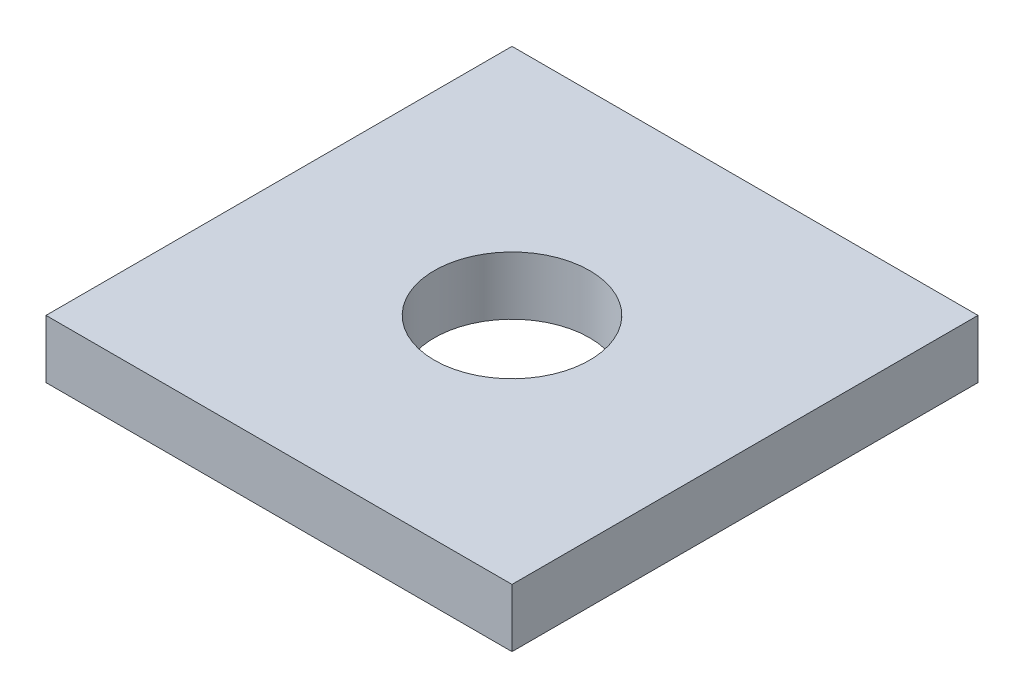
ISO-10303-21;
HEADER;
FILE_DESCRIPTION(('STEP AP214'),'2;1');
FILE_NAME('part.step','',(''),(''),'','','');
FILE_SCHEMA(('AUTOMOTIVE_DESIGN { 1 0 10303 214 1 1 1 1 }'));
ENDSEC;
DATA;
#1=APPLICATION_CONTEXT('core data for automotive mechanical design processes');
#2=APPLICATION_PROTOCOL_DEFINITION('international standard','automotive_design',2000,#1);
#3=PRODUCT_CONTEXT('',#1,'mechanical');
#4=PRODUCT('Part','Part','',(#3));
#5=PRODUCT_RELATED_PRODUCT_CATEGORY('part','',(#4));
#6=PRODUCT_DEFINITION_FORMATION('','',#4);
#7=PRODUCT_DEFINITION_CONTEXT('part definition',#1,'design');
#8=PRODUCT_DEFINITION('design','',#6,#7);
#9=PRODUCT_DEFINITION_SHAPE('','',#8);
#10=(LENGTH_UNIT() NAMED_UNIT(*) SI_UNIT(.MILLI.,.METRE.));
#11=(NAMED_UNIT(*) PLANE_ANGLE_UNIT() SI_UNIT($,.RADIAN.));
#12=(NAMED_UNIT(*) SI_UNIT($,.STERADIAN.) SOLID_ANGLE_UNIT());
#13=UNCERTAINTY_MEASURE_WITH_UNIT(LENGTH_MEASURE(1.E-05),#10,'distance_accuracy_value','');
#14=(GEOMETRIC_REPRESENTATION_CONTEXT(3) GLOBAL_UNCERTAINTY_ASSIGNED_CONTEXT((#13)) GLOBAL_UNIT_ASSIGNED_CONTEXT((#10,
#11,#12)) REPRESENTATION_CONTEXT('',''));
#15=CARTESIAN_POINT('',(0.,0.,0.));
#16=DIRECTION('',(0.,0.,1.));
#17=DIRECTION('',(1.,0.,0.));
#18=AXIS2_PLACEMENT_3D('',#15,#16,#17);
#19=CARTESIAN_POINT('',(0.,1.5,0.));
#20=DIRECTION('',(0.,-1.,0.));
#21=DIRECTION('',(0.,0.,-1.));
#22=AXIS2_PLACEMENT_3D('',#19,#20,#21);
#23=PLANE('',#22);
#24=DIRECTION('',(0.,0.,1.));
#25=VECTOR('',#24,1.);
#26=CARTESIAN_POINT('',(0.,1.5,0.));
#27=LINE('',#26,#25);
#28=CARTESIAN_POINT('',(0.,1.5,-12.));
#29=VERTEX_POINT('',#28);
#30=CARTESIAN_POINT('',(0.,1.5,0.));
#31=VERTEX_POINT('',#30);
#32=EDGE_CURVE('E86',#29,#31,#27,.T.);
#33=ORIENTED_EDGE('',*,*,#32,.T.);
#34=DIRECTION('',(1.,0.,0.));
#35=VECTOR('',#34,1.);
#36=CARTESIAN_POINT('',(0.,1.5,0.));
#37=LINE('',#36,#35);
#38=CARTESIAN_POINT('',(12.,1.5,0.));
#39=VERTEX_POINT('',#38);
#40=EDGE_CURVE('E81',#31,#39,#37,.T.);
#41=ORIENTED_EDGE('',*,*,#40,.T.);
#42=DIRECTION('',(0.,0.,-1.));
#43=VECTOR('',#42,1.);
#44=CARTESIAN_POINT('',(12.,1.5,0.));
#45=LINE('',#44,#43);
#46=CARTESIAN_POINT('',(12.,1.5,-12.));
#47=VERTEX_POINT('',#46);
#48=EDGE_CURVE('E84',#39,#47,#45,.T.);
#49=ORIENTED_EDGE('',*,*,#48,.T.);
#50=DIRECTION('',(-1.,0.,0.));
#51=VECTOR('',#50,1.);
#52=CARTESIAN_POINT('',(0.,1.5,-12.));
#53=LINE('',#52,#51);
#54=EDGE_CURVE('E51',#47,#29,#53,.T.);
#55=ORIENTED_EDGE('',*,*,#54,.T.);
#56=EDGE_LOOP('',(#33,#41,#49,#55));
#57=FACE_BOUND('',#56,.T.);
#58=CARTESIAN_POINT('',(6.,1.5,-6.));
#59=DIRECTION('',(0.,1.,0.));
#60=DIRECTION('',(0.,0.,1.));
#61=AXIS2_PLACEMENT_3D('',#58,#59,#60);
#62=CIRCLE('',#61,2.);
#63=CARTESIAN_POINT('',(6.,1.5,-4.));
#64=VERTEX_POINT('',#63);
#65=EDGE_CURVE('E101',#64,#64,#62,.T.);
#66=ORIENTED_EDGE('',*,*,#65,.F.);
#67=EDGE_LOOP('',(#66));
#68=FACE_BOUND('',#67,.T.);
#69=ADVANCED_FACE('F34',(#57,#68),#23,.F.);
#70=CARTESIAN_POINT('',(0.,0.,0.));
#71=DIRECTION('',(0.,-1.,0.));
#72=DIRECTION('',(0.,0.,-1.));
#73=AXIS2_PLACEMENT_3D('',#70,#71,#72);
#74=PLANE('',#73);
#75=DIRECTION('',(0.,0.,1.));
#76=VECTOR('',#75,1.);
#77=CARTESIAN_POINT('',(0.,0.,0.));
#78=LINE('',#77,#76);
#79=CARTESIAN_POINT('',(0.,0.,-12.));
#80=VERTEX_POINT('',#79);
#81=CARTESIAN_POINT('',(0.,0.,0.));
#82=VERTEX_POINT('',#81);
#83=EDGE_CURVE('E98',#80,#82,#78,.T.);
#84=ORIENTED_EDGE('',*,*,#83,.F.);
#85=DIRECTION('',(-1.,0.,0.));
#86=VECTOR('',#85,1.);
#87=CARTESIAN_POINT('',(0.,0.,-12.));
#88=LINE('',#87,#86);
#89=CARTESIAN_POINT('',(12.,0.,-12.));
#90=VERTEX_POINT('',#89);
#91=EDGE_CURVE('E74',#90,#80,#88,.T.);
#92=ORIENTED_EDGE('',*,*,#91,.F.);
#93=DIRECTION('',(0.,0.,-1.));
#94=VECTOR('',#93,1.);
#95=CARTESIAN_POINT('',(12.,0.,0.));
#96=LINE('',#95,#94);
#97=CARTESIAN_POINT('',(12.,0.,0.));
#98=VERTEX_POINT('',#97);
#99=EDGE_CURVE('E68',#98,#90,#96,.T.);
#100=ORIENTED_EDGE('',*,*,#99,.F.);
#101=DIRECTION('',(1.,0.,0.));
#102=VECTOR('',#101,1.);
#103=CARTESIAN_POINT('',(0.,0.,0.));
#104=LINE('',#103,#102);
#105=EDGE_CURVE('E90',#82,#98,#104,.T.);
#106=ORIENTED_EDGE('',*,*,#105,.F.);
#107=EDGE_LOOP('',(#84,#92,#100,#106));
#108=FACE_BOUND('',#107,.T.);
#109=CARTESIAN_POINT('',(6.,0.,-6.));
#110=DIRECTION('',(0.,1.,0.));
#111=DIRECTION('',(0.,0.,1.));
#112=AXIS2_PLACEMENT_3D('',#109,#110,#111);
#113=CIRCLE('',#112,2.);
#114=CARTESIAN_POINT('',(6.,0.,-4.));
#115=VERTEX_POINT('',#114);
#116=EDGE_CURVE('E113',#115,#115,#113,.T.);
#117=ORIENTED_EDGE('',*,*,#116,.T.);
#118=EDGE_LOOP('',(#117));
#119=FACE_BOUND('',#118,.T.);
#120=ADVANCED_FACE('F109',(#108,#119),#74,.T.);
#121=CARTESIAN_POINT('',(0.,1.5,0.));
#122=DIRECTION('',(1.,0.,0.));
#123=DIRECTION('',(0.,0.,-1.));
#124=AXIS2_PLACEMENT_3D('',#121,#122,#123);
#125=PLANE('',#124);
#126=ORIENTED_EDGE('',*,*,#83,.T.);
#127=DIRECTION('',(0.,-1.,0.));
#128=VECTOR('',#127,1.);
#129=CARTESIAN_POINT('',(0.,1.5,0.));
#130=LINE('',#129,#128);
#131=EDGE_CURVE('E11',#31,#82,#130,.T.);
#132=ORIENTED_EDGE('',*,*,#131,.F.);
#133=ORIENTED_EDGE('',*,*,#32,.F.);
#134=DIRECTION('',(0.,-1.,0.));
#135=VECTOR('',#134,1.);
#136=CARTESIAN_POINT('',(0.,1.5,-12.));
#137=LINE('',#136,#135);
#138=EDGE_CURVE('E94',#29,#80,#137,.T.);
#139=ORIENTED_EDGE('',*,*,#138,.T.);
#140=EDGE_LOOP('',(#126,#132,#133,#139));
#141=FACE_BOUND('',#140,.T.);
#142=ADVANCED_FACE('F36',(#141),#125,.F.);
#143=CARTESIAN_POINT('',(0.,1.5,0.));
#144=DIRECTION('',(0.,0.,-1.));
#145=DIRECTION('',(-1.,0.,0.));
#146=AXIS2_PLACEMENT_3D('',#143,#144,#145);
#147=PLANE('',#146);
#148=ORIENTED_EDGE('',*,*,#105,.T.);
#149=DIRECTION('',(0.,-1.,0.));
#150=VECTOR('',#149,1.);
#151=CARTESIAN_POINT('',(12.,1.5,0.));
#152=LINE('',#151,#150);
#153=EDGE_CURVE('E43',#39,#98,#152,.T.);
#154=ORIENTED_EDGE('',*,*,#153,.F.);
#155=ORIENTED_EDGE('',*,*,#40,.F.);
#156=ORIENTED_EDGE('',*,*,#131,.T.);
#157=EDGE_LOOP('',(#148,#154,#155,#156));
#158=FACE_BOUND('',#157,.T.);
#159=ADVANCED_FACE('F89',(#158),#147,.F.);
#160=CARTESIAN_POINT('',(12.,1.5,0.));
#161=DIRECTION('',(-1.,0.,0.));
#162=DIRECTION('',(0.,0.,1.));
#163=AXIS2_PLACEMENT_3D('',#160,#161,#162);
#164=PLANE('',#163);
#165=ORIENTED_EDGE('',*,*,#99,.T.);
#166=DIRECTION('',(0.,-1.,0.));
#167=VECTOR('',#166,1.);
#168=CARTESIAN_POINT('',(12.,1.5,-12.));
#169=LINE('',#168,#167);
#170=EDGE_CURVE('E91',#47,#90,#169,.T.);
#171=ORIENTED_EDGE('',*,*,#170,.F.);
#172=ORIENTED_EDGE('',*,*,#48,.F.);
#173=ORIENTED_EDGE('',*,*,#153,.T.);
#174=EDGE_LOOP('',(#165,#171,#172,#173));
#175=FACE_BOUND('',#174,.T.);
#176=ADVANCED_FACE('F92',(#175),#164,.F.);
#177=CARTESIAN_POINT('',(0.,1.5,-12.));
#178=DIRECTION('',(0.,0.,1.));
#179=DIRECTION('',(1.,0.,0.));
#180=AXIS2_PLACEMENT_3D('',#177,#178,#179);
#181=PLANE('',#180);
#182=ORIENTED_EDGE('',*,*,#91,.T.);
#183=ORIENTED_EDGE('',*,*,#138,.F.);
#184=ORIENTED_EDGE('',*,*,#54,.F.);
#185=ORIENTED_EDGE('',*,*,#170,.T.);
#186=EDGE_LOOP('',(#182,#183,#184,#185));
#187=FACE_BOUND('',#186,.T.);
#188=ADVANCED_FACE('F106',(#187),#181,.F.);
#189=CARTESIAN_POINT('',(6.,1.5,-6.));
#190=DIRECTION('',(0.,-1.,0.));
#191=DIRECTION('',(0.,0.,-1.));
#192=AXIS2_PLACEMENT_3D('',#189,#190,#191);
#193=CYLINDRICAL_SURFACE('',#192,2.);
#194=ORIENTED_EDGE('',*,*,#65,.T.);
#195=EDGE_LOOP('',(#194));
#196=FACE_BOUND('',#195,.T.);
#197=ORIENTED_EDGE('',*,*,#116,.F.);
#198=EDGE_LOOP('',(#197));
#199=FACE_BOUND('',#198,.T.);
#200=ADVANCED_FACE('F119',(#196,#199),#193,.F.);
#201=CLOSED_SHELL('',(#69,#120,#142,#159,#176,#188,#200));
#202=MANIFOLD_SOLID_BREP('B2',#201);
#203=ADVANCED_BREP_SHAPE_REPRESENTATION('',(#18,#202),#14);
#204=SHAPE_DEFINITION_REPRESENTATION(#9,#203);
ENDSEC;
END-ISO-10303-21;
